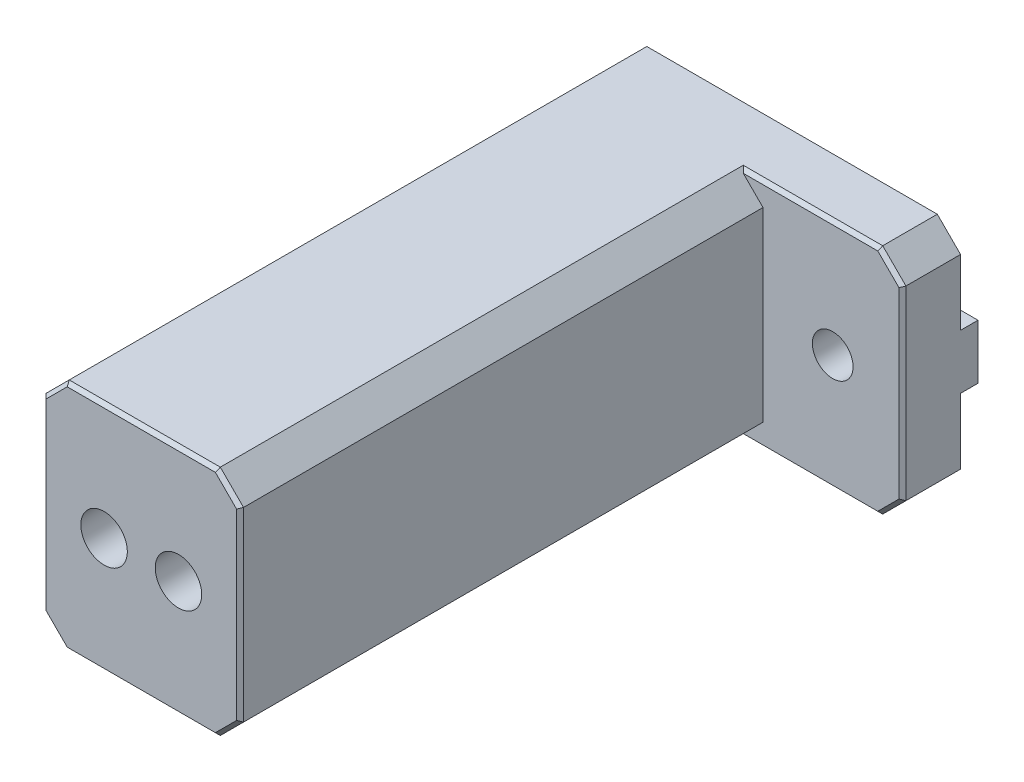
from build123d import *

# Parameters (mm, degrees)
SKIZZE1_W                          = 29
SKIZZE1_H                          = 20
AUFSATZ_LINEAR_AUSTRAGEN1_DEPTH    = 50
SKIZZE2_W                          = 29
SKIZZE2_H                          = 4.7
AUFSATZ_LINEAR_AUSTRAGEN2_DEPTH    = 1.5
F_4_0_4_DURCHMESSER_BOHRUNG1_D     = 4
F_4_0_4_DURCHMESSER_BOHRUNG1_DEPTH = 9
SKIZZE5_W                          = 12
SKIZZE5_H                          = 20
SCHNITT_LINEAR_AUSTRAGEN1_DEPTH    = 45
F_3_5_3_5_DURCHMESSER_BOHRUNG1_D   = 3.5
FASE1_SIZE                         = 2
FASE2_SIZE                         = 0.3


with BuildPart() as part:
    # Skizze1 → Aufsatz-Linear austragen1 (new body)
    with BuildSketch(Plane.XY):
        Rectangle(SKIZZE1_W, SKIZZE1_H)
    extrude(amount=AUFSATZ_LINEAR_AUSTRAGEN1_DEPTH)

    # Skizze2 → Aufsatz-Linear austragen2 (add)
    with BuildSketch(Plane(origin=(0, 0, 0), x_dir=(-1, 0, 0), z_dir=(0, 0, -1))):
        Rectangle(SKIZZE2_W, SKIZZE2_H)
    extrude(amount=AUFSATZ_LINEAR_AUSTRAGEN2_DEPTH)

    # 4.0 _4_ Durchmesser Bohrung1
    with Locations(Plane.XY.offset(50)):
        with Locations((-9.2, 0), (-2.8, 0)):
            Hole(F_4_0_4_DURCHMESSER_BOHRUNG1_D / 2, depth=F_4_0_4_DURCHMESSER_BOHRUNG1_DEPTH)

    # Skizze5 → Schnitt-Linear austragen1 (cut)
    with BuildSketch(Plane.XY.offset(50)):
        with Locations((8.5, 0)):
            Rectangle(SKIZZE5_W, SKIZZE5_H)
    extrude(amount=-SCHNITT_LINEAR_AUSTRAGEN1_DEPTH, mode=Mode.SUBTRACT)

    # 3.5 _3.5_ Durchmesser Bohrung1 (through all)
    with Locations(Plane.XY.offset(5)):
        with Locations((8.5, 0)):
            Hole(F_3_5_3_5_DURCHMESSER_BOHRUNG1_D / 2)

    # Fase1
    fase1_edges = [part.edges().sort_by_distance(p)[0] for p in [
        (14.5, -10, 2.5),
        (14.5, 10, 2.5),
        (2.5, -10, 27.5),
        (2.5, 10, 27.5),
        (-14.5, -10, 25),
        (-14.5, 10, 25),
    ]]
    chamfer(fase1_edges, length=FASE1_SIZE)

    # Fase2
    fase2_edges = [part.edges().sort_by_distance(p)[0] for p in [
        (6.5, -10, 5),
        (-6, 10, 50),
        (6.5, 10, 5),
        (14.5, 0, 5),
        (13.5, -9, 5),
        (13.5, 9, 5),
        (-6, -10, 50),
        (-14.5, 0, 50),
        (2.5, 0, 50),
        (1.5, 9, 50),
        (-13.5, 9, 50),
        (1.5, -9, 50),
        (-13.5, -9, 50),
    ]]
    chamfer(fase2_edges, length=FASE2_SIZE)


solid = part.part
